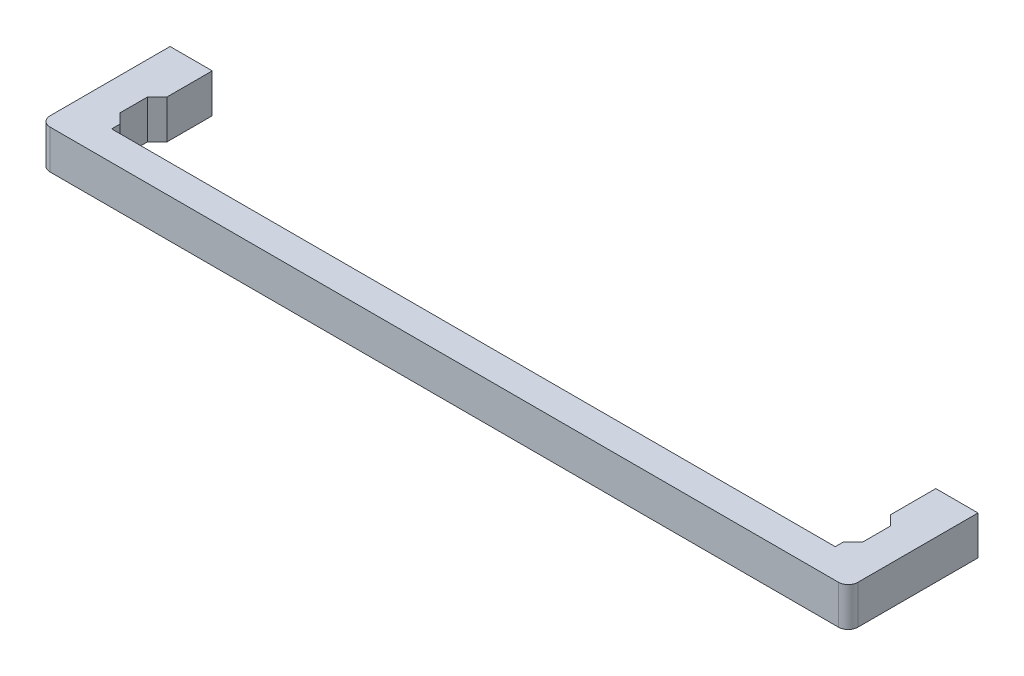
ISO-10303-21;
HEADER;
FILE_DESCRIPTION(('STEP AP214'),'2;1');
FILE_NAME('part.step','',(''),(''),'','','');
FILE_SCHEMA(('AUTOMOTIVE_DESIGN { 1 0 10303 214 1 1 1 1 }'));
ENDSEC;
DATA;
#1=APPLICATION_CONTEXT('core data for automotive mechanical design processes');
#2=APPLICATION_PROTOCOL_DEFINITION('international standard','automotive_design',2000,#1);
#3=PRODUCT_CONTEXT('',#1,'mechanical');
#4=PRODUCT('Part','Part','',(#3));
#5=PRODUCT_RELATED_PRODUCT_CATEGORY('part','',(#4));
#6=PRODUCT_DEFINITION_FORMATION('','',#4);
#7=PRODUCT_DEFINITION_CONTEXT('part definition',#1,'design');
#8=PRODUCT_DEFINITION('design','',#6,#7);
#9=PRODUCT_DEFINITION_SHAPE('','',#8);
#10=(LENGTH_UNIT() NAMED_UNIT(*) SI_UNIT(.MILLI.,.METRE.));
#11=(NAMED_UNIT(*) PLANE_ANGLE_UNIT() SI_UNIT($,.RADIAN.));
#12=(NAMED_UNIT(*) SI_UNIT($,.STERADIAN.) SOLID_ANGLE_UNIT());
#13=UNCERTAINTY_MEASURE_WITH_UNIT(LENGTH_MEASURE(1.E-05),#10,'distance_accuracy_value','');
#14=(GEOMETRIC_REPRESENTATION_CONTEXT(3) GLOBAL_UNCERTAINTY_ASSIGNED_CONTEXT((#13)) GLOBAL_UNIT_ASSIGNED_CONTEXT((#10,
#11,#12)) REPRESENTATION_CONTEXT('',''));
#15=CARTESIAN_POINT('',(0.,0.,0.));
#16=DIRECTION('',(0.,0.,1.));
#17=DIRECTION('',(1.,0.,0.));
#18=AXIS2_PLACEMENT_3D('',#15,#16,#17);
#19=CARTESIAN_POINT('',(117.5,-6.,40.));
#20=DIRECTION('',(0.,0.,-1.));
#21=DIRECTION('',(0.,1.,0.));
#22=AXIS2_PLACEMENT_3D('',#19,#20,#21);
#23=PLANE('',#22);
#24=DIRECTION('',(0.,1.,0.));
#25=VECTOR('',#24,1.);
#26=CARTESIAN_POINT('',(-4.,-6.,40.));
#27=LINE('',#26,#25);
#28=CARTESIAN_POINT('',(-4.,-6.,40.));
#29=VERTEX_POINT('',#28);
#30=CARTESIAN_POINT('',(-4.,6.,40.));
#31=VERTEX_POINT('',#30);
#32=EDGE_CURVE('E9',#29,#31,#27,.T.);
#33=ORIENTED_EDGE('',*,*,#32,.F.);
#34=DIRECTION('',(-1.,0.,0.));
#35=VECTOR('',#34,1.);
#36=CARTESIAN_POINT('',(117.5,-6.,40.));
#37=LINE('',#36,#35);
#38=CARTESIAN_POINT('',(239.,-6.,40.));
#39=VERTEX_POINT('',#38);
#40=EDGE_CURVE('E157',#39,#29,#37,.T.);
#41=ORIENTED_EDGE('',*,*,#40,.F.);
#42=DIRECTION('',(0.,1.,0.));
#43=VECTOR('',#42,1.);
#44=CARTESIAN_POINT('',(239.,-6.,40.));
#45=LINE('',#44,#43);
#46=CARTESIAN_POINT('',(239.,6.,40.));
#47=VERTEX_POINT('',#46);
#48=EDGE_CURVE('E155',#39,#47,#45,.T.);
#49=ORIENTED_EDGE('',*,*,#48,.T.);
#50=DIRECTION('',(-1.,0.,0.));
#51=VECTOR('',#50,1.);
#52=CARTESIAN_POINT('',(117.5,6.,40.));
#53=LINE('',#52,#51);
#54=EDGE_CURVE('E141',#47,#31,#53,.T.);
#55=ORIENTED_EDGE('',*,*,#54,.T.);
#56=EDGE_LOOP('',(#33,#41,#49,#55));
#57=FACE_BOUND('',#56,.T.);
#58=ADVANCED_FACE('F14',(#57),#23,.F.);
#59=CARTESIAN_POINT('',(-4.,-6.,37.));
#60=DIRECTION('',(0.,1.,0.));
#61=DIRECTION('',(-1.,0.,0.));
#62=AXIS2_PLACEMENT_3D('',#59,#60,#61);
#63=CYLINDRICAL_SURFACE('',#62,3.);
#64=DIRECTION('',(0.,1.,0.));
#65=VECTOR('',#64,1.);
#66=CARTESIAN_POINT('',(-7.,-6.,37.));
#67=LINE('',#66,#65);
#68=CARTESIAN_POINT('',(-7.,-6.,37.));
#69=VERTEX_POINT('',#68);
#70=CARTESIAN_POINT('',(-7.,6.,37.));
#71=VERTEX_POINT('',#70);
#72=EDGE_CURVE('E22',#69,#71,#67,.T.);
#73=ORIENTED_EDGE('',*,*,#72,.F.);
#74=CARTESIAN_POINT('',(-4.,-6.,37.));
#75=DIRECTION('',(0.,-1.,0.));
#76=DIRECTION('',(1.,0.,0.));
#77=AXIS2_PLACEMENT_3D('',#74,#75,#76);
#78=CIRCLE('',#77,3.);
#79=EDGE_CURVE('E260',#29,#69,#78,.T.);
#80=ORIENTED_EDGE('',*,*,#79,.F.);
#81=ORIENTED_EDGE('',*,*,#32,.T.);
#82=CARTESIAN_POINT('',(-4.,6.,37.));
#83=DIRECTION('',(0.,-1.,0.));
#84=DIRECTION('',(1.,0.,0.));
#85=AXIS2_PLACEMENT_3D('',#82,#83,#84);
#86=CIRCLE('',#85,3.);
#87=EDGE_CURVE('E150',#31,#71,#86,.T.);
#88=ORIENTED_EDGE('',*,*,#87,.T.);
#89=EDGE_LOOP('',(#73,#80,#81,#88));
#90=FACE_BOUND('',#89,.T.);
#91=ADVANCED_FACE('F16',(#90),#63,.T.);
#92=CARTESIAN_POINT('',(-7.,-6.,37.));
#93=DIRECTION('',(1.,0.,0.));
#94=DIRECTION('',(0.,1.,0.));
#95=AXIS2_PLACEMENT_3D('',#92,#93,#94);
#96=PLANE('',#95);
#97=DIRECTION('',(0.,1.,0.));
#98=VECTOR('',#97,1.);
#99=CARTESIAN_POINT('',(-7.,-6.,0.));
#100=LINE('',#99,#98);
#101=CARTESIAN_POINT('',(-7.,-6.,0.));
#102=VERTEX_POINT('',#101);
#103=CARTESIAN_POINT('',(-7.,6.,0.));
#104=VERTEX_POINT('',#103);
#105=EDGE_CURVE('E295',#102,#104,#100,.T.);
#106=ORIENTED_EDGE('',*,*,#105,.F.);
#107=DIRECTION('',(0.,0.,-1.));
#108=VECTOR('',#107,1.);
#109=CARTESIAN_POINT('',(-7.,-6.,37.));
#110=LINE('',#109,#108);
#111=EDGE_CURVE('E263',#69,#102,#110,.T.);
#112=ORIENTED_EDGE('',*,*,#111,.F.);
#113=ORIENTED_EDGE('',*,*,#72,.T.);
#114=DIRECTION('',(0.,0.,-1.));
#115=VECTOR('',#114,1.);
#116=CARTESIAN_POINT('',(-7.,6.,37.));
#117=LINE('',#116,#115);
#118=EDGE_CURVE('E236',#71,#104,#117,.T.);
#119=ORIENTED_EDGE('',*,*,#118,.T.);
#120=EDGE_LOOP('',(#106,#112,#113,#119));
#121=FACE_BOUND('',#120,.T.);
#122=ADVANCED_FACE('F298',(#121),#96,.F.);
#123=CARTESIAN_POINT('',(-7.,-6.,0.));
#124=DIRECTION('',(0.,0.,1.));
#125=DIRECTION('',(0.,-1.,0.));
#126=AXIS2_PLACEMENT_3D('',#123,#124,#125);
#127=PLANE('',#126);
#128=CARTESIAN_POINT('',(0.,0.,0.));
#129=DIRECTION('',(0.,0.,-1.));
#130=DIRECTION('',(0.,1.,0.));
#131=AXIS2_PLACEMENT_3D('',#128,#129,#130);
#132=CIRCLE('',#131,2.5);
#133=CARTESIAN_POINT('',(0.,2.5,0.));
#134=VERTEX_POINT('',#133);
#135=EDGE_CURVE('E161',#134,#134,#132,.T.);
#136=ORIENTED_EDGE('',*,*,#135,.F.);
#137=EDGE_LOOP('',(#136));
#138=FACE_BOUND('',#137,.T.);
#139=DIRECTION('',(0.,1.,0.));
#140=VECTOR('',#139,1.);
#141=CARTESIAN_POINT('',(6.,-6.,0.));
#142=LINE('',#141,#140);
#143=CARTESIAN_POINT('',(6.,-6.,0.));
#144=VERTEX_POINT('',#143);
#145=CARTESIAN_POINT('',(6.,6.,0.));
#146=VERTEX_POINT('',#145);
#147=EDGE_CURVE('E293',#144,#146,#142,.T.);
#148=ORIENTED_EDGE('',*,*,#147,.F.);
#149=DIRECTION('',(1.,0.,0.));
#150=VECTOR('',#149,1.);
#151=CARTESIAN_POINT('',(-7.,-6.,0.));
#152=LINE('',#151,#150);
#153=EDGE_CURVE('E266',#102,#144,#152,.T.);
#154=ORIENTED_EDGE('',*,*,#153,.F.);
#155=ORIENTED_EDGE('',*,*,#105,.T.);
#156=DIRECTION('',(1.,0.,0.));
#157=VECTOR('',#156,1.);
#158=CARTESIAN_POINT('',(-7.,6.,0.));
#159=LINE('',#158,#157);
#160=EDGE_CURVE('E239',#104,#146,#159,.T.);
#161=ORIENTED_EDGE('',*,*,#160,.T.);
#162=EDGE_LOOP('',(#148,#154,#155,#161));
#163=FACE_BOUND('',#162,.T.);
#164=ADVANCED_FACE('F305',(#138,#163),#127,.F.);
#165=CARTESIAN_POINT('',(6.,-6.,0.));
#166=DIRECTION('',(-1.,0.,0.));
#167=DIRECTION('',(0.,-1.,0.));
#168=AXIS2_PLACEMENT_3D('',#165,#166,#167);
#169=PLANE('',#168);
#170=DIRECTION('',(0.,1.,0.));
#171=VECTOR('',#170,1.);
#172=CARTESIAN_POINT('',(6.,-6.,14.));
#173=LINE('',#172,#171);
#174=CARTESIAN_POINT('',(6.,-6.,14.));
#175=VERTEX_POINT('',#174);
#176=CARTESIAN_POINT('',(6.,6.,14.));
#177=VERTEX_POINT('',#176);
#178=EDGE_CURVE('E291',#175,#177,#173,.T.);
#179=ORIENTED_EDGE('',*,*,#178,.F.);
#180=DIRECTION('',(0.,0.,1.));
#181=VECTOR('',#180,1.);
#182=CARTESIAN_POINT('',(6.,-6.,0.));
#183=LINE('',#182,#181);
#184=EDGE_CURVE('E269',#144,#175,#183,.T.);
#185=ORIENTED_EDGE('',*,*,#184,.F.);
#186=ORIENTED_EDGE('',*,*,#147,.T.);
#187=DIRECTION('',(0.,0.,1.));
#188=VECTOR('',#187,1.);
#189=CARTESIAN_POINT('',(6.,6.,0.));
#190=LINE('',#189,#188);
#191=EDGE_CURVE('E242',#146,#177,#190,.T.);
#192=ORIENTED_EDGE('',*,*,#191,.T.);
#193=EDGE_LOOP('',(#179,#185,#186,#192));
#194=FACE_BOUND('',#193,.T.);
#195=ADVANCED_FACE('F351',(#194),#169,.F.);
#196=CARTESIAN_POINT('',(6.,-6.,14.));
#197=DIRECTION('',(-0.707106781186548,0.,-0.707106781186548));
#198=DIRECTION('',(0.707106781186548,0.,-0.707106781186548));
#199=AXIS2_PLACEMENT_3D('',#196,#197,#198);
#200=PLANE('',#199);
#201=DIRECTION('',(0.,1.,0.));
#202=VECTOR('',#201,1.);
#203=CARTESIAN_POINT('',(3.,-6.,17.));
#204=LINE('',#203,#202);
#205=CARTESIAN_POINT('',(3.,-6.,17.));
#206=VERTEX_POINT('',#205);
#207=CARTESIAN_POINT('',(3.,6.,17.));
#208=VERTEX_POINT('',#207);
#209=EDGE_CURVE('E289',#206,#208,#204,.T.);
#210=ORIENTED_EDGE('',*,*,#209,.F.);
#211=DIRECTION('',(-0.707106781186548,0.,0.707106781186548));
#212=VECTOR('',#211,1.);
#213=CARTESIAN_POINT('',(6.,-6.,14.));
#214=LINE('',#213,#212);
#215=EDGE_CURVE('E272',#175,#206,#214,.T.);
#216=ORIENTED_EDGE('',*,*,#215,.F.);
#217=ORIENTED_EDGE('',*,*,#178,.T.);
#218=DIRECTION('',(-0.707106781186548,0.,0.707106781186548));
#219=VECTOR('',#218,1.);
#220=CARTESIAN_POINT('',(6.,6.,14.));
#221=LINE('',#220,#219);
#222=EDGE_CURVE('E245',#177,#208,#221,.T.);
#223=ORIENTED_EDGE('',*,*,#222,.T.);
#224=EDGE_LOOP('',(#210,#216,#217,#223));
#225=FACE_BOUND('',#224,.T.);
#226=ADVANCED_FACE('F349',(#225),#200,.F.);
#227=CARTESIAN_POINT('',(3.,-6.,25.5));
#228=DIRECTION('',(1.,0.,0.));
#229=DIRECTION('',(0.,1.,0.));
#230=AXIS2_PLACEMENT_3D('',#227,#228,#229);
#231=PLANE('',#230);
#232=DIRECTION('',(0.,1.,0.));
#233=VECTOR('',#232,1.);
#234=CARTESIAN_POINT('',(3.,-6.,25.5));
#235=LINE('',#234,#233);
#236=CARTESIAN_POINT('',(3.,-6.,25.5));
#237=VERTEX_POINT('',#236);
#238=CARTESIAN_POINT('',(3.,6.,25.5));
#239=VERTEX_POINT('',#238);
#240=EDGE_CURVE('E287',#237,#239,#235,.T.);
#241=ORIENTED_EDGE('',*,*,#240,.F.);
#242=DIRECTION('',(0.,0.,-1.));
#243=VECTOR('',#242,1.);
#244=CARTESIAN_POINT('',(3.,-6.,25.5));
#245=LINE('',#244,#243);
#246=EDGE_CURVE('E275',#237,#206,#245,.T.);
#247=ORIENTED_EDGE('',*,*,#246,.T.);
#248=ORIENTED_EDGE('',*,*,#209,.T.);
#249=DIRECTION('',(0.,0.,-1.));
#250=VECTOR('',#249,1.);
#251=CARTESIAN_POINT('',(3.,6.,25.5));
#252=LINE('',#251,#250);
#253=EDGE_CURVE('E248',#239,#208,#252,.T.);
#254=ORIENTED_EDGE('',*,*,#253,.F.);
#255=EDGE_LOOP('',(#241,#247,#248,#254));
#256=FACE_BOUND('',#255,.T.);
#257=ADVANCED_FACE('F345',(#256),#231,.T.);
#258=CARTESIAN_POINT('',(6.,-6.,28.5));
#259=DIRECTION('',(0.707106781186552,0.,-0.707106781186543));
#260=DIRECTION('',(0.707106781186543,0.,0.707106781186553));
#261=AXIS2_PLACEMENT_3D('',#258,#259,#260);
#262=PLANE('',#261);
#263=DIRECTION('',(0.,1.,0.));
#264=VECTOR('',#263,1.);
#265=CARTESIAN_POINT('',(6.,-6.,28.5));
#266=LINE('',#265,#264);
#267=CARTESIAN_POINT('',(6.,-6.,28.5));
#268=VERTEX_POINT('',#267);
#269=CARTESIAN_POINT('',(6.,6.,28.5));
#270=VERTEX_POINT('',#269);
#271=EDGE_CURVE('E37',#268,#270,#266,.T.);
#272=ORIENTED_EDGE('',*,*,#271,.F.);
#273=DIRECTION('',(-0.707106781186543,0.,-0.707106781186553));
#274=VECTOR('',#273,1.);
#275=CARTESIAN_POINT('',(6.,-6.,28.5));
#276=LINE('',#275,#274);
#277=EDGE_CURVE('E278',#268,#237,#276,.T.);
#278=ORIENTED_EDGE('',*,*,#277,.T.);
#279=ORIENTED_EDGE('',*,*,#240,.T.);
#280=DIRECTION('',(-0.707106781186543,0.,-0.707106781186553));
#281=VECTOR('',#280,1.);
#282=CARTESIAN_POINT('',(6.,6.,28.5));
#283=LINE('',#282,#281);
#284=EDGE_CURVE('E251',#270,#239,#283,.T.);
#285=ORIENTED_EDGE('',*,*,#284,.F.);
#286=EDGE_LOOP('',(#272,#278,#279,#285));
#287=FACE_BOUND('',#286,.T.);
#288=ADVANCED_FACE('F342',(#287),#262,.T.);
#289=CARTESIAN_POINT('',(6.,-6.,28.5));
#290=DIRECTION('',(-1.,0.,0.));
#291=DIRECTION('',(0.,-1.,0.));
#292=AXIS2_PLACEMENT_3D('',#289,#290,#291);
#293=PLANE('',#292);
#294=DIRECTION('',(0.,1.,0.));
#295=VECTOR('',#294,1.);
#296=CARTESIAN_POINT('',(6.,-6.,31.));
#297=LINE('',#296,#295);
#298=CARTESIAN_POINT('',(6.,-6.,31.));
#299=VERTEX_POINT('',#298);
#300=CARTESIAN_POINT('',(6.,6.,31.));
#301=VERTEX_POINT('',#300);
#302=EDGE_CURVE('E29',#299,#301,#297,.T.);
#303=ORIENTED_EDGE('',*,*,#302,.F.);
#304=DIRECTION('',(0.,0.,1.));
#305=VECTOR('',#304,1.);
#306=CARTESIAN_POINT('',(6.,-6.,28.5));
#307=LINE('',#306,#305);
#308=EDGE_CURVE('E280',#268,#299,#307,.T.);
#309=ORIENTED_EDGE('',*,*,#308,.F.);
#310=ORIENTED_EDGE('',*,*,#271,.T.);
#311=DIRECTION('',(0.,0.,1.));
#312=VECTOR('',#311,1.);
#313=CARTESIAN_POINT('',(6.,6.,28.5));
#314=LINE('',#313,#312);
#315=EDGE_CURVE('E254',#270,#301,#314,.T.);
#316=ORIENTED_EDGE('',*,*,#315,.T.);
#317=EDGE_LOOP('',(#303,#309,#310,#316));
#318=FACE_BOUND('',#317,.T.);
#319=ADVANCED_FACE('F341',(#318),#293,.F.);
#320=CARTESIAN_POINT('',(117.5,-6.,31.));
#321=DIRECTION('',(0.,0.,-1.));
#322=DIRECTION('',(0.,1.,0.));
#323=AXIS2_PLACEMENT_3D('',#320,#321,#322);
#324=PLANE('',#323);
#325=DIRECTION('',(-1.,0.,0.));
#326=VECTOR('',#325,1.);
#327=CARTESIAN_POINT('',(117.5,6.,31.));
#328=LINE('',#327,#326);
#329=CARTESIAN_POINT('',(229.,6.,31.));
#330=VERTEX_POINT('',#329);
#331=EDGE_CURVE('E256',#330,#301,#328,.T.);
#332=ORIENTED_EDGE('',*,*,#331,.F.);
#333=DIRECTION('',(0.,1.,0.));
#334=VECTOR('',#333,1.);
#335=CARTESIAN_POINT('',(229.,-6.,31.));
#336=LINE('',#335,#334);
#337=CARTESIAN_POINT('',(229.,-6.,31.));
#338=VERTEX_POINT('',#337);
#339=EDGE_CURVE('E215',#338,#330,#336,.T.);
#340=ORIENTED_EDGE('',*,*,#339,.F.);
#341=DIRECTION('',(-1.,0.,0.));
#342=VECTOR('',#341,1.);
#343=CARTESIAN_POINT('',(117.5,-6.,31.));
#344=LINE('',#343,#342);
#345=EDGE_CURVE('E282',#338,#299,#344,.T.);
#346=ORIENTED_EDGE('',*,*,#345,.T.);
#347=ORIENTED_EDGE('',*,*,#302,.T.);
#348=EDGE_LOOP('',(#332,#340,#346,#347));
#349=FACE_BOUND('',#348,.T.);
#350=ADVANCED_FACE('F340',(#349),#324,.T.);
#351=CARTESIAN_POINT('',(-4.,-6.,37.));
#352=DIRECTION('',(0.,-1.,0.));
#353=DIRECTION('',(1.,0.,0.));
#354=AXIS2_PLACEMENT_3D('',#351,#352,#353);
#355=PLANE('',#354);
#356=ORIENTED_EDGE('',*,*,#40,.T.);
#357=ORIENTED_EDGE('',*,*,#79,.T.);
#358=ORIENTED_EDGE('',*,*,#111,.T.);
#359=ORIENTED_EDGE('',*,*,#153,.T.);
#360=ORIENTED_EDGE('',*,*,#184,.T.);
#361=ORIENTED_EDGE('',*,*,#215,.T.);
#362=ORIENTED_EDGE('',*,*,#246,.F.);
#363=ORIENTED_EDGE('',*,*,#277,.F.);
#364=ORIENTED_EDGE('',*,*,#308,.T.);
#365=ORIENTED_EDGE('',*,*,#345,.F.);
#366=DIRECTION('',(0.,0.,1.));
#367=VECTOR('',#366,1.);
#368=CARTESIAN_POINT('',(229.,-6.,28.5));
#369=LINE('',#368,#367);
#370=CARTESIAN_POINT('',(229.,-6.,28.5));
#371=VERTEX_POINT('',#370);
#372=EDGE_CURVE('E212',#371,#338,#369,.T.);
#373=ORIENTED_EDGE('',*,*,#372,.F.);
#374=DIRECTION('',(0.707106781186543,0.,-0.707106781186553));
#375=VECTOR('',#374,1.);
#376=CARTESIAN_POINT('',(229.,-6.,28.5));
#377=LINE('',#376,#375);
#378=CARTESIAN_POINT('',(232.,-6.,25.5));
#379=VERTEX_POINT('',#378);
#380=EDGE_CURVE('E209',#371,#379,#377,.T.);
#381=ORIENTED_EDGE('',*,*,#380,.T.);
#382=DIRECTION('',(0.,0.,-1.));
#383=VECTOR('',#382,1.);
#384=CARTESIAN_POINT('',(232.,-6.,25.5));
#385=LINE('',#384,#383);
#386=CARTESIAN_POINT('',(232.,-6.,17.));
#387=VERTEX_POINT('',#386);
#388=EDGE_CURVE('E206',#379,#387,#385,.T.);
#389=ORIENTED_EDGE('',*,*,#388,.T.);
#390=DIRECTION('',(0.707106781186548,0.,0.707106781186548));
#391=VECTOR('',#390,1.);
#392=CARTESIAN_POINT('',(229.,-6.,14.));
#393=LINE('',#392,#391);
#394=CARTESIAN_POINT('',(229.,-6.,14.));
#395=VERTEX_POINT('',#394);
#396=EDGE_CURVE('E203',#395,#387,#393,.T.);
#397=ORIENTED_EDGE('',*,*,#396,.F.);
#398=DIRECTION('',(0.,0.,1.));
#399=VECTOR('',#398,1.);
#400=CARTESIAN_POINT('',(229.,-6.,0.));
#401=LINE('',#400,#399);
#402=CARTESIAN_POINT('',(229.,-6.,0.));
#403=VERTEX_POINT('',#402);
#404=EDGE_CURVE('E200',#403,#395,#401,.T.);
#405=ORIENTED_EDGE('',*,*,#404,.F.);
#406=DIRECTION('',(-1.,0.,0.));
#407=VECTOR('',#406,1.);
#408=CARTESIAN_POINT('',(242.,-6.,0.));
#409=LINE('',#408,#407);
#410=CARTESIAN_POINT('',(242.,-6.,0.));
#411=VERTEX_POINT('',#410);
#412=EDGE_CURVE('E197',#411,#403,#409,.T.);
#413=ORIENTED_EDGE('',*,*,#412,.F.);
#414=DIRECTION('',(0.,0.,-1.));
#415=VECTOR('',#414,1.);
#416=CARTESIAN_POINT('',(242.,-6.,37.));
#417=LINE('',#416,#415);
#418=CARTESIAN_POINT('',(242.,-6.,37.));
#419=VERTEX_POINT('',#418);
#420=EDGE_CURVE('E194',#419,#411,#417,.T.);
#421=ORIENTED_EDGE('',*,*,#420,.F.);
#422=CARTESIAN_POINT('',(239.,-6.,37.));
#423=DIRECTION('',(0.,1.,0.));
#424=DIRECTION('',(-1.,0.,0.));
#425=AXIS2_PLACEMENT_3D('',#422,#423,#424);
#426=CIRCLE('',#425,3.);
#427=EDGE_CURVE('E192',#39,#419,#426,.T.);
#428=ORIENTED_EDGE('',*,*,#427,.F.);
#429=EDGE_LOOP('',(#356,#357,#358,#359,#360,#361,#362,#363,#364,#365,#373,#381,#389,#397,#405,
#413,#421,#428));
#430=FACE_BOUND('',#429,.T.);
#431=ADVANCED_FACE('F308',(#430),#355,.T.);
#432=CARTESIAN_POINT('',(-4.,6.,37.));
#433=DIRECTION('',(0.,-1.,0.));
#434=DIRECTION('',(1.,0.,0.));
#435=AXIS2_PLACEMENT_3D('',#432,#433,#434);
#436=PLANE('',#435);
#437=ORIENTED_EDGE('',*,*,#54,.F.);
#438=CARTESIAN_POINT('',(239.,6.,37.));
#439=DIRECTION('',(0.,1.,0.));
#440=DIRECTION('',(-1.,0.,0.));
#441=AXIS2_PLACEMENT_3D('',#438,#439,#440);
#442=CIRCLE('',#441,3.);
#443=CARTESIAN_POINT('',(242.,6.,37.));
#444=VERTEX_POINT('',#443);
#445=EDGE_CURVE('E146',#47,#444,#442,.T.);
#446=ORIENTED_EDGE('',*,*,#445,.T.);
#447=DIRECTION('',(0.,0.,-1.));
#448=VECTOR('',#447,1.);
#449=CARTESIAN_POINT('',(242.,6.,37.));
#450=LINE('',#449,#448);
#451=CARTESIAN_POINT('',(242.,6.,0.));
#452=VERTEX_POINT('',#451);
#453=EDGE_CURVE('E165',#444,#452,#450,.T.);
#454=ORIENTED_EDGE('',*,*,#453,.T.);
#455=DIRECTION('',(-1.,0.,0.));
#456=VECTOR('',#455,1.);
#457=CARTESIAN_POINT('',(242.,6.,0.));
#458=LINE('',#457,#456);
#459=CARTESIAN_POINT('',(229.,6.,0.));
#460=VERTEX_POINT('',#459);
#461=EDGE_CURVE('E168',#452,#460,#458,.T.);
#462=ORIENTED_EDGE('',*,*,#461,.T.);
#463=DIRECTION('',(0.,0.,1.));
#464=VECTOR('',#463,1.);
#465=CARTESIAN_POINT('',(229.,6.,0.));
#466=LINE('',#465,#464);
#467=CARTESIAN_POINT('',(229.,6.,14.));
#468=VERTEX_POINT('',#467);
#469=EDGE_CURVE('E177',#460,#468,#466,.T.);
#470=ORIENTED_EDGE('',*,*,#469,.T.);
#471=DIRECTION('',(0.707106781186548,0.,0.707106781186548));
#472=VECTOR('',#471,1.);
#473=CARTESIAN_POINT('',(229.,6.,14.));
#474=LINE('',#473,#472);
#475=CARTESIAN_POINT('',(232.,6.,17.));
#476=VERTEX_POINT('',#475);
#477=EDGE_CURVE('E180',#468,#476,#474,.T.);
#478=ORIENTED_EDGE('',*,*,#477,.T.);
#479=DIRECTION('',(0.,0.,-1.));
#480=VECTOR('',#479,1.);
#481=CARTESIAN_POINT('',(232.,6.,25.5));
#482=LINE('',#481,#480);
#483=CARTESIAN_POINT('',(232.,6.,25.5));
#484=VERTEX_POINT('',#483);
#485=EDGE_CURVE('E183',#484,#476,#482,.T.);
#486=ORIENTED_EDGE('',*,*,#485,.F.);
#487=DIRECTION('',(0.707106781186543,0.,-0.707106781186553));
#488=VECTOR('',#487,1.);
#489=CARTESIAN_POINT('',(229.,6.,28.5));
#490=LINE('',#489,#488);
#491=CARTESIAN_POINT('',(229.,6.,28.5));
#492=VERTEX_POINT('',#491);
#493=EDGE_CURVE('E186',#492,#484,#490,.T.);
#494=ORIENTED_EDGE('',*,*,#493,.F.);
#495=DIRECTION('',(0.,0.,1.));
#496=VECTOR('',#495,1.);
#497=CARTESIAN_POINT('',(229.,6.,28.5));
#498=LINE('',#497,#496);
#499=EDGE_CURVE('E189',#492,#330,#498,.T.);
#500=ORIENTED_EDGE('',*,*,#499,.T.);
#501=ORIENTED_EDGE('',*,*,#331,.T.);
#502=ORIENTED_EDGE('',*,*,#315,.F.);
#503=ORIENTED_EDGE('',*,*,#284,.T.);
#504=ORIENTED_EDGE('',*,*,#253,.T.);
#505=ORIENTED_EDGE('',*,*,#222,.F.);
#506=ORIENTED_EDGE('',*,*,#191,.F.);
#507=ORIENTED_EDGE('',*,*,#160,.F.);
#508=ORIENTED_EDGE('',*,*,#118,.F.);
#509=ORIENTED_EDGE('',*,*,#87,.F.);
#510=EDGE_LOOP('',(#437,#446,#454,#462,#470,#478,#486,#494,#500,#501,#502,#503,#504,#505,#506,
#507,#508,#509));
#511=FACE_BOUND('',#510,.T.);
#512=ADVANCED_FACE('F143',(#511),#436,.F.);
#513=CARTESIAN_POINT('',(0.,0.,10.));
#514=DIRECTION('',(0.,0.,-1.));
#515=DIRECTION('',(0.,1.,0.));
#516=AXIS2_PLACEMENT_3D('',#513,#514,#515);
#517=CYLINDRICAL_SURFACE('',#516,2.5);
#518=CARTESIAN_POINT('',(0.,0.,10.));
#519=DIRECTION('',(0.,0.,-1.));
#520=DIRECTION('',(0.,1.,0.));
#521=AXIS2_PLACEMENT_3D('',#518,#519,#520);
#522=CIRCLE('',#521,2.5);
#523=CARTESIAN_POINT('',(0.,2.5,10.));
#524=VERTEX_POINT('',#523);
#525=EDGE_CURVE('E152',#524,#524,#522,.T.);
#526=ORIENTED_EDGE('',*,*,#525,.F.);
#527=EDGE_LOOP('',(#526));
#528=FACE_BOUND('',#527,.T.);
#529=ORIENTED_EDGE('',*,*,#135,.T.);
#530=EDGE_LOOP('',(#529));
#531=FACE_BOUND('',#530,.T.);
#532=ADVANCED_FACE('F417',(#528,#531),#517,.F.);
#533=CARTESIAN_POINT('',(0.,0.,10.));
#534=DIRECTION('',(0.,0.,-1.));
#535=DIRECTION('',(0.,1.,0.));
#536=AXIS2_PLACEMENT_3D('',#533,#534,#535);
#537=PLANE('',#536);
#538=ORIENTED_EDGE('',*,*,#525,.T.);
#539=EDGE_LOOP('',(#538));
#540=FACE_BOUND('',#539,.T.);
#541=ADVANCED_FACE('F418',(#540),#537,.T.);
#542=CARTESIAN_POINT('',(239.,-6.,37.));
#543=DIRECTION('',(0.,1.,0.));
#544=DIRECTION('',(1.,0.,0.));
#545=AXIS2_PLACEMENT_3D('',#542,#543,#544);
#546=CYLINDRICAL_SURFACE('',#545,3.);
#547=DIRECTION('',(0.,1.,0.));
#548=VECTOR('',#547,1.);
#549=CARTESIAN_POINT('',(242.,-6.,37.));
#550=LINE('',#549,#548);
#551=EDGE_CURVE('E162',#419,#444,#550,.T.);
#552=ORIENTED_EDGE('',*,*,#551,.T.);
#553=ORIENTED_EDGE('',*,*,#445,.F.);
#554=ORIENTED_EDGE('',*,*,#48,.F.);
#555=ORIENTED_EDGE('',*,*,#427,.T.);
#556=EDGE_LOOP('',(#552,#553,#554,#555));
#557=FACE_BOUND('',#556,.T.);
#558=ADVANCED_FACE('F164',(#557),#546,.T.);
#559=CARTESIAN_POINT('',(242.,-6.,37.));
#560=DIRECTION('',(-1.,0.,0.));
#561=DIRECTION('',(0.,1.,0.));
#562=AXIS2_PLACEMENT_3D('',#559,#560,#561);
#563=PLANE('',#562);
#564=DIRECTION('',(0.,1.,0.));
#565=VECTOR('',#564,1.);
#566=CARTESIAN_POINT('',(242.,-6.,0.));
#567=LINE('',#566,#565);
#568=EDGE_CURVE('E228',#411,#452,#567,.T.);
#569=ORIENTED_EDGE('',*,*,#568,.T.);
#570=ORIENTED_EDGE('',*,*,#453,.F.);
#571=ORIENTED_EDGE('',*,*,#551,.F.);
#572=ORIENTED_EDGE('',*,*,#420,.T.);
#573=EDGE_LOOP('',(#569,#570,#571,#572));
#574=FACE_BOUND('',#573,.T.);
#575=ADVANCED_FACE('F314',(#574),#563,.F.);
#576=CARTESIAN_POINT('',(242.,-6.,0.));
#577=DIRECTION('',(0.,0.,1.));
#578=DIRECTION('',(0.,-1.,0.));
#579=AXIS2_PLACEMENT_3D('',#576,#577,#578);
#580=PLANE('',#579);
#581=CARTESIAN_POINT('',(235.,0.,0.));
#582=DIRECTION('',(0.,0.,1.));
#583=DIRECTION('',(0.,1.,0.));
#584=AXIS2_PLACEMENT_3D('',#581,#582,#583);
#585=CIRCLE('',#584,2.5);
#586=CARTESIAN_POINT('',(235.,2.5,0.));
#587=VERTEX_POINT('',#586);
#588=EDGE_CURVE('E171',#587,#587,#585,.T.);
#589=ORIENTED_EDGE('',*,*,#588,.T.);
#590=EDGE_LOOP('',(#589));
#591=FACE_BOUND('',#590,.T.);
#592=DIRECTION('',(0.,1.,0.));
#593=VECTOR('',#592,1.);
#594=CARTESIAN_POINT('',(229.,-6.,0.));
#595=LINE('',#594,#593);
#596=EDGE_CURVE('E226',#403,#460,#595,.T.);
#597=ORIENTED_EDGE('',*,*,#596,.T.);
#598=ORIENTED_EDGE('',*,*,#461,.F.);
#599=ORIENTED_EDGE('',*,*,#568,.F.);
#600=ORIENTED_EDGE('',*,*,#412,.T.);
#601=EDGE_LOOP('',(#597,#598,#599,#600));
#602=FACE_BOUND('',#601,.T.);
#603=ADVANCED_FACE('F318',(#591,#602),#580,.F.);
#604=CARTESIAN_POINT('',(229.,-6.,0.));
#605=DIRECTION('',(1.,0.,0.));
#606=DIRECTION('',(0.,-1.,0.));
#607=AXIS2_PLACEMENT_3D('',#604,#605,#606);
#608=PLANE('',#607);
#609=DIRECTION('',(0.,1.,0.));
#610=VECTOR('',#609,1.);
#611=CARTESIAN_POINT('',(229.,-6.,14.));
#612=LINE('',#611,#610);
#613=EDGE_CURVE('E224',#395,#468,#612,.T.);
#614=ORIENTED_EDGE('',*,*,#613,.T.);
#615=ORIENTED_EDGE('',*,*,#469,.F.);
#616=ORIENTED_EDGE('',*,*,#596,.F.);
#617=ORIENTED_EDGE('',*,*,#404,.T.);
#618=EDGE_LOOP('',(#614,#615,#616,#617));
#619=FACE_BOUND('',#618,.T.);
#620=ADVANCED_FACE('F320',(#619),#608,.F.);
#621=CARTESIAN_POINT('',(229.,-6.,14.));
#622=DIRECTION('',(0.707106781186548,0.,-0.707106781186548));
#623=DIRECTION('',(-0.707106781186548,0.,-0.707106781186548));
#624=AXIS2_PLACEMENT_3D('',#621,#622,#623);
#625=PLANE('',#624);
#626=DIRECTION('',(0.,1.,0.));
#627=VECTOR('',#626,1.);
#628=CARTESIAN_POINT('',(232.,-6.,17.));
#629=LINE('',#628,#627);
#630=EDGE_CURVE('E222',#387,#476,#629,.T.);
#631=ORIENTED_EDGE('',*,*,#630,.T.);
#632=ORIENTED_EDGE('',*,*,#477,.F.);
#633=ORIENTED_EDGE('',*,*,#613,.F.);
#634=ORIENTED_EDGE('',*,*,#396,.T.);
#635=EDGE_LOOP('',(#631,#632,#633,#634));
#636=FACE_BOUND('',#635,.T.);
#637=ADVANCED_FACE('F325',(#636),#625,.F.);
#638=CARTESIAN_POINT('',(232.,-6.,25.5));
#639=DIRECTION('',(-1.,0.,0.));
#640=DIRECTION('',(0.,1.,0.));
#641=AXIS2_PLACEMENT_3D('',#638,#639,#640);
#642=PLANE('',#641);
#643=DIRECTION('',(0.,1.,0.));
#644=VECTOR('',#643,1.);
#645=CARTESIAN_POINT('',(232.,-6.,25.5));
#646=LINE('',#645,#644);
#647=EDGE_CURVE('E220',#379,#484,#646,.T.);
#648=ORIENTED_EDGE('',*,*,#647,.T.);
#649=ORIENTED_EDGE('',*,*,#485,.T.);
#650=ORIENTED_EDGE('',*,*,#630,.F.);
#651=ORIENTED_EDGE('',*,*,#388,.F.);
#652=EDGE_LOOP('',(#648,#649,#650,#651));
#653=FACE_BOUND('',#652,.T.);
#654=ADVANCED_FACE('F328',(#653),#642,.T.);
#655=CARTESIAN_POINT('',(229.,-6.,28.5));
#656=DIRECTION('',(-0.707106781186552,0.,-0.707106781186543));
#657=DIRECTION('',(-0.707106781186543,0.,0.707106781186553));
#658=AXIS2_PLACEMENT_3D('',#655,#656,#657);
#659=PLANE('',#658);
#660=DIRECTION('',(0.,1.,0.));
#661=VECTOR('',#660,1.);
#662=CARTESIAN_POINT('',(229.,-6.,28.5));
#663=LINE('',#662,#661);
#664=EDGE_CURVE('E218',#371,#492,#663,.T.);
#665=ORIENTED_EDGE('',*,*,#664,.T.);
#666=ORIENTED_EDGE('',*,*,#493,.T.);
#667=ORIENTED_EDGE('',*,*,#647,.F.);
#668=ORIENTED_EDGE('',*,*,#380,.F.);
#669=EDGE_LOOP('',(#665,#666,#667,#668));
#670=FACE_BOUND('',#669,.T.);
#671=ADVANCED_FACE('F332',(#670),#659,.T.);
#672=CARTESIAN_POINT('',(229.,-6.,28.5));
#673=DIRECTION('',(1.,0.,0.));
#674=DIRECTION('',(0.,-1.,0.));
#675=AXIS2_PLACEMENT_3D('',#672,#673,#674);
#676=PLANE('',#675);
#677=ORIENTED_EDGE('',*,*,#339,.T.);
#678=ORIENTED_EDGE('',*,*,#499,.F.);
#679=ORIENTED_EDGE('',*,*,#664,.F.);
#680=ORIENTED_EDGE('',*,*,#372,.T.);
#681=EDGE_LOOP('',(#677,#678,#679,#680));
#682=FACE_BOUND('',#681,.T.);
#683=ADVANCED_FACE('F336',(#682),#676,.F.);
#684=CARTESIAN_POINT('',(235.,0.,10.));
#685=DIRECTION('',(0.,0.,-1.));
#686=DIRECTION('',(0.,1.,0.));
#687=AXIS2_PLACEMENT_3D('',#684,#685,#686);
#688=CYLINDRICAL_SURFACE('',#687,2.5);
#689=CARTESIAN_POINT('',(235.,0.,10.));
#690=DIRECTION('',(0.,0.,1.));
#691=DIRECTION('',(0.,1.,0.));
#692=AXIS2_PLACEMENT_3D('',#689,#690,#691);
#693=CIRCLE('',#692,2.5);
#694=CARTESIAN_POINT('',(235.,2.5,10.));
#695=VERTEX_POINT('',#694);
#696=EDGE_CURVE('E166',#695,#695,#693,.T.);
#697=ORIENTED_EDGE('',*,*,#696,.T.);
#698=EDGE_LOOP('',(#697));
#699=FACE_BOUND('',#698,.T.);
#700=ORIENTED_EDGE('',*,*,#588,.F.);
#701=EDGE_LOOP('',(#700));
#702=FACE_BOUND('',#701,.T.);
#703=ADVANCED_FACE('F491',(#699,#702),#688,.F.);
#704=CARTESIAN_POINT('',(235.,0.,10.));
#705=DIRECTION('',(0.,0.,-1.));
#706=DIRECTION('',(0.,1.,0.));
#707=AXIS2_PLACEMENT_3D('',#704,#705,#706);
#708=PLANE('',#707);
#709=ORIENTED_EDGE('',*,*,#696,.F.);
#710=EDGE_LOOP('',(#709));
#711=FACE_BOUND('',#710,.T.);
#712=ADVANCED_FACE('F493',(#711),#708,.T.);
#713=CLOSED_SHELL('',(#58,#91,#122,#164,#195,#226,#257,#288,#319,#350,#431,#512,#532,#541,#558,
#575,#603,#620,#637,#654,#671,#683,#703,#712));
#714=MANIFOLD_SOLID_BREP('B1',#713);
#715=ADVANCED_BREP_SHAPE_REPRESENTATION('',(#18,#714),#14);
#716=SHAPE_DEFINITION_REPRESENTATION(#9,#715);
ENDSEC;
END-ISO-10303-21;
